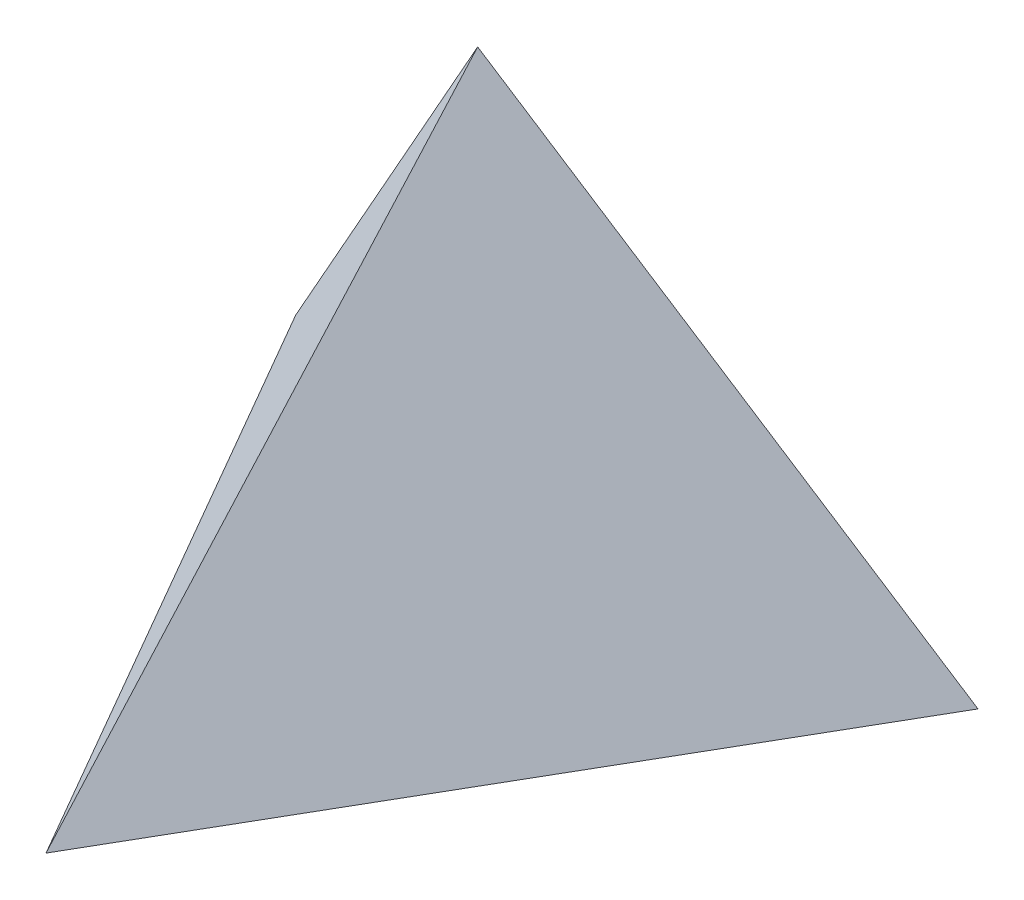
ISO-10303-21;
HEADER;
FILE_DESCRIPTION(('STEP AP214'),'2;1');
FILE_NAME('part.step','',(''),(''),'','','');
FILE_SCHEMA(('AUTOMOTIVE_DESIGN { 1 0 10303 214 1 1 1 1 }'));
ENDSEC;
DATA;
#1=APPLICATION_CONTEXT('core data for automotive mechanical design processes');
#2=APPLICATION_PROTOCOL_DEFINITION('international standard','automotive_design',2000,#1);
#3=PRODUCT_CONTEXT('',#1,'mechanical');
#4=PRODUCT('Part','Part','',(#3));
#5=PRODUCT_RELATED_PRODUCT_CATEGORY('part','',(#4));
#6=PRODUCT_DEFINITION_FORMATION('','',#4);
#7=PRODUCT_DEFINITION_CONTEXT('part definition',#1,'design');
#8=PRODUCT_DEFINITION('design','',#6,#7);
#9=PRODUCT_DEFINITION_SHAPE('','',#8);
#10=(LENGTH_UNIT() NAMED_UNIT(*) SI_UNIT(.MILLI.,.METRE.));
#11=(NAMED_UNIT(*) PLANE_ANGLE_UNIT() SI_UNIT($,.RADIAN.));
#12=(NAMED_UNIT(*) SI_UNIT($,.STERADIAN.) SOLID_ANGLE_UNIT());
#13=UNCERTAINTY_MEASURE_WITH_UNIT(LENGTH_MEASURE(1.E-05),#10,'distance_accuracy_value','');
#14=(GEOMETRIC_REPRESENTATION_CONTEXT(3) GLOBAL_UNCERTAINTY_ASSIGNED_CONTEXT((#13)) GLOBAL_UNIT_ASSIGNED_CONTEXT((#10,
#11,#12)) REPRESENTATION_CONTEXT('',''));
#15=CARTESIAN_POINT('',(0.,0.,0.));
#16=DIRECTION('',(0.,0.,1.));
#17=DIRECTION('',(1.,0.,0.));
#18=AXIS2_PLACEMENT_3D('',#15,#16,#17);
#19=CARTESIAN_POINT('',(0.,0.,18.9807621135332));
#20=DIRECTION('',(0.,-1.,0.));
#21=DIRECTION('',(0.,0.,-1.));
#22=AXIS2_PLACEMENT_3D('',#19,#20,#21);
#23=PLANE('',#22);
#24=DIRECTION('',(0.5,0.,0.866025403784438));
#25=VECTOR('',#24,1.);
#26=CARTESIAN_POINT('',(-15.,0.,-7.));
#27=LINE('',#26,#25);
#28=CARTESIAN_POINT('',(-15.,0.,-7.));
#29=VERTEX_POINT('',#28);
#30=CARTESIAN_POINT('',(0.,0.,18.9807621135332));
#31=VERTEX_POINT('',#30);
#32=EDGE_CURVE('E69',#29,#31,#27,.T.);
#33=ORIENTED_EDGE('',*,*,#32,.F.);
#34=DIRECTION('',(-1.,0.,0.));
#35=VECTOR('',#34,1.);
#36=CARTESIAN_POINT('',(15.,0.,-7.));
#37=LINE('',#36,#35);
#38=CARTESIAN_POINT('',(15.,0.,-7.));
#39=VERTEX_POINT('',#38);
#40=EDGE_CURVE('E12',#39,#29,#37,.T.);
#41=ORIENTED_EDGE('',*,*,#40,.F.);
#42=DIRECTION('',(0.5,0.,-0.866025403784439));
#43=VECTOR('',#42,1.);
#44=CARTESIAN_POINT('',(15.,0.,-7.));
#45=LINE('',#44,#43);
#46=EDGE_CURVE('E47',#31,#39,#45,.T.);
#47=ORIENTED_EDGE('',*,*,#46,.F.);
#48=EDGE_LOOP('',(#33,#41,#47));
#49=FACE_BOUND('',#48,.T.);
#50=ADVANCED_FACE('F34',(#49),#23,.T.);
#51=CARTESIAN_POINT('',(0.,21.21,0.));
#52=DIRECTION('',(0.790500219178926,0.408426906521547,0.456395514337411));
#53=DIRECTION('',(0.5,0.,-0.866025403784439));
#54=AXIS2_PLACEMENT_3D('',#51,#52,#53);
#55=PLANE('',#54);
#56=DIRECTION('',(0.,-0.745182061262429,0.666861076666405));
#57=VECTOR('',#56,1.);
#58=CARTESIAN_POINT('',(0.,21.21,0.));
#59=LINE('',#58,#57);
#60=CARTESIAN_POINT('',(0.,21.21,0.));
#61=VERTEX_POINT('',#60);
#62=EDGE_CURVE('E65',#61,#31,#59,.T.);
#63=ORIENTED_EDGE('',*,*,#62,.T.);
#64=ORIENTED_EDGE('',*,*,#46,.T.);
#65=DIRECTION('',(0.557522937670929,-0.788337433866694,-0.2601773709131));
#66=VECTOR('',#65,1.);
#67=CARTESIAN_POINT('',(0.,21.21,0.));
#68=LINE('',#67,#66);
#69=EDGE_CURVE('E72',#61,#39,#68,.T.);
#70=ORIENTED_EDGE('',*,*,#69,.F.);
#71=EDGE_LOOP('',(#63,#64,#70));
#72=FACE_BOUND('',#71,.T.);
#73=ADVANCED_FACE('F75',(#72),#55,.T.);
#74=CARTESIAN_POINT('',(0.,21.21,0.));
#75=DIRECTION('',(0.,0.313405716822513,-0.949619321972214));
#76=DIRECTION('',(0.,0.949619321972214,0.313405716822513));
#77=AXIS2_PLACEMENT_3D('',#74,#75,#76);
#78=PLANE('',#77);
#79=ORIENTED_EDGE('',*,*,#69,.T.);
#80=ORIENTED_EDGE('',*,*,#40,.T.);
#81=DIRECTION('',(-0.557522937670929,-0.788337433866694,-0.2601773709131));
#82=VECTOR('',#81,1.);
#83=CARTESIAN_POINT('',(0.,21.21,0.));
#84=LINE('',#83,#82);
#85=EDGE_CURVE('E68',#61,#29,#84,.T.);
#86=ORIENTED_EDGE('',*,*,#85,.F.);
#87=EDGE_LOOP('',(#79,#80,#86));
#88=FACE_BOUND('',#87,.T.);
#89=ADVANCED_FACE('F79',(#88),#78,.T.);
#90=CARTESIAN_POINT('',(0.,21.21,0.));
#91=DIRECTION('',(-0.790500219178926,0.408426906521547,0.456395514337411));
#92=DIRECTION('',(0.5,0.,0.866025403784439));
#93=AXIS2_PLACEMENT_3D('',#90,#91,#92);
#94=PLANE('',#93);
#95=ORIENTED_EDGE('',*,*,#85,.T.);
#96=ORIENTED_EDGE('',*,*,#32,.T.);
#97=ORIENTED_EDGE('',*,*,#62,.F.);
#98=EDGE_LOOP('',(#95,#96,#97));
#99=FACE_BOUND('',#98,.T.);
#100=ADVANCED_FACE('F36',(#99),#94,.T.);
#101=CLOSED_SHELL('',(#50,#73,#89,#100));
#102=MANIFOLD_SOLID_BREP('B2',#101);
#103=ADVANCED_BREP_SHAPE_REPRESENTATION('',(#18,#102),#14);
#104=SHAPE_DEFINITION_REPRESENTATION(#9,#103);
ENDSEC;
END-ISO-10303-21;
